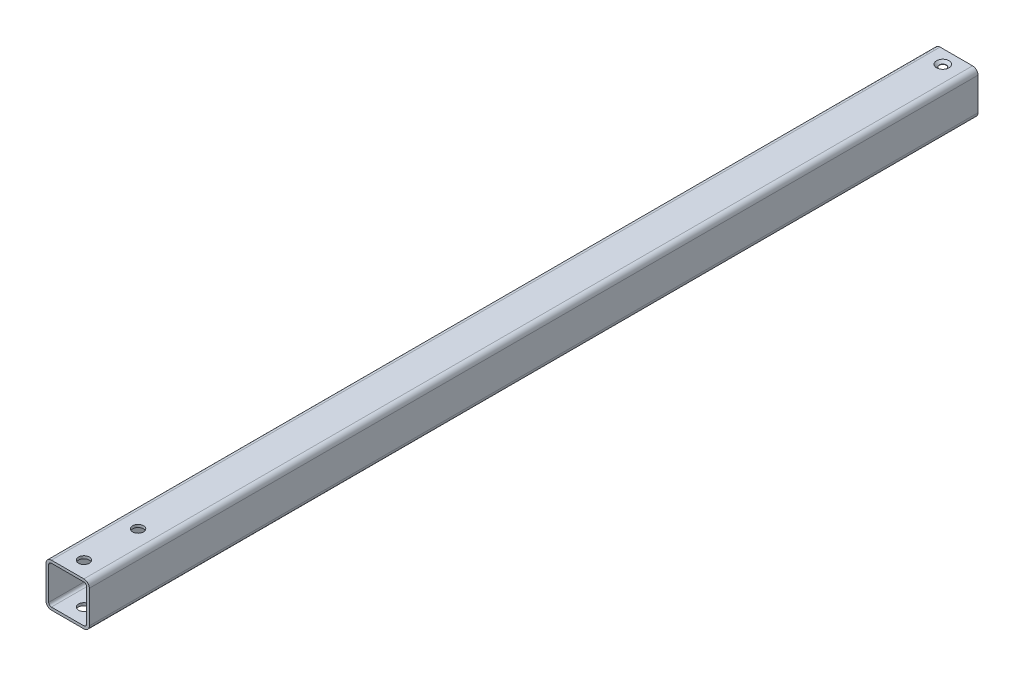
ISO-10303-21;
HEADER;
FILE_DESCRIPTION(('STEP AP214'),'2;1');
FILE_NAME('part.step','',(''),(''),'','','');
FILE_SCHEMA(('AUTOMOTIVE_DESIGN { 1 0 10303 214 1 1 1 1 }'));
ENDSEC;
DATA;
#1=APPLICATION_CONTEXT('core data for automotive mechanical design processes');
#2=APPLICATION_PROTOCOL_DEFINITION('international standard','automotive_design',2000,#1);
#3=PRODUCT_CONTEXT('',#1,'mechanical');
#4=PRODUCT('Part','Part','',(#3));
#5=PRODUCT_RELATED_PRODUCT_CATEGORY('part','',(#4));
#6=PRODUCT_DEFINITION_FORMATION('','',#4);
#7=PRODUCT_DEFINITION_CONTEXT('part definition',#1,'design');
#8=PRODUCT_DEFINITION('design','',#6,#7);
#9=PRODUCT_DEFINITION_SHAPE('','',#8);
#10=(LENGTH_UNIT() NAMED_UNIT(*) SI_UNIT(.MILLI.,.METRE.));
#11=(NAMED_UNIT(*) PLANE_ANGLE_UNIT() SI_UNIT($,.RADIAN.));
#12=(NAMED_UNIT(*) SI_UNIT($,.STERADIAN.) SOLID_ANGLE_UNIT());
#13=UNCERTAINTY_MEASURE_WITH_UNIT(LENGTH_MEASURE(1.E-05),#10,'distance_accuracy_value','');
#14=(GEOMETRIC_REPRESENTATION_CONTEXT(3) GLOBAL_UNCERTAINTY_ASSIGNED_CONTEXT((#13)) GLOBAL_UNIT_ASSIGNED_CONTEXT((#10,
#11,#12)) REPRESENTATION_CONTEXT('',''));
#15=CARTESIAN_POINT('',(0.,0.,0.));
#16=DIRECTION('',(0.,0.,1.));
#17=DIRECTION('',(1.,0.,0.));
#18=AXIS2_PLACEMENT_3D('',#15,#16,#17);
#19=CARTESIAN_POINT('',(12.7,12.7,520.7));
#20=DIRECTION('',(0.,-1.,0.));
#21=DIRECTION('',(1.,0.,0.));
#22=AXIS2_PLACEMENT_3D('',#19,#20,#21);
#23=PLANE('',#22);
#24=CARTESIAN_POINT('',(0.,12.7,479.425));
#25=DIRECTION('',(0.,-1.,0.));
#26=DIRECTION('',(1.,0.,0.));
#27=AXIS2_PLACEMENT_3D('',#24,#25,#26);
#28=CIRCLE('',#27,3.175);
#29=CARTESIAN_POINT('',(3.175,12.7,479.425));
#30=VERTEX_POINT('',#29);
#31=EDGE_CURVE('E285',#30,#30,#28,.T.);
#32=ORIENTED_EDGE('',*,*,#31,.T.);
#33=EDGE_LOOP('',(#32));
#34=FACE_BOUND('',#33,.T.);
#35=CARTESIAN_POINT('',(0.,12.7,511.175));
#36=DIRECTION('',(0.,-1.,0.));
#37=DIRECTION('',(1.,0.,0.));
#38=AXIS2_PLACEMENT_3D('',#35,#36,#37);
#39=CIRCLE('',#38,3.175);
#40=CARTESIAN_POINT('',(3.175,12.7,511.175));
#41=VERTEX_POINT('',#40);
#42=EDGE_CURVE('E280',#41,#41,#39,.T.);
#43=ORIENTED_EDGE('',*,*,#42,.T.);
#44=EDGE_LOOP('',(#43));
#45=FACE_BOUND('',#44,.T.);
#46=CARTESIAN_POINT('',(0.,12.7,7.9248));
#47=DIRECTION('',(0.,-1.,0.));
#48=DIRECTION('',(1.,0.,0.));
#49=AXIS2_PLACEMENT_3D('',#46,#47,#48);
#50=CIRCLE('',#49,3.63220000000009);
#51=CARTESIAN_POINT('',(3.63220000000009,12.7,7.9248));
#52=VERTEX_POINT('',#51);
#53=EDGE_CURVE('E12',#52,#52,#50,.T.);
#54=ORIENTED_EDGE('',*,*,#53,.T.);
#55=EDGE_LOOP('',(#54));
#56=FACE_BOUND('',#55,.T.);
#57=DIRECTION('',(-1.,0.,0.));
#58=VECTOR('',#57,1.);
#59=CARTESIAN_POINT('',(12.7,12.7,0.));
#60=LINE('',#59,#58);
#61=CARTESIAN_POINT('',(9.525,12.7,0.));
#62=VERTEX_POINT('',#61);
#63=CARTESIAN_POINT('',(-9.525,12.7,0.));
#64=VERTEX_POINT('',#63);
#65=EDGE_CURVE('E214',#62,#64,#60,.T.);
#66=ORIENTED_EDGE('',*,*,#65,.T.);
#67=DIRECTION('',(0.,0.,-1.));
#68=VECTOR('',#67,1.);
#69=CARTESIAN_POINT('',(-9.525,12.7,520.7));
#70=LINE('',#69,#68);
#71=CARTESIAN_POINT('',(-9.525,12.7,520.7));
#72=VERTEX_POINT('',#71);
#73=EDGE_CURVE('E178',#64,#72,#70,.F.);
#74=ORIENTED_EDGE('',*,*,#73,.T.);
#75=DIRECTION('',(-1.,0.,0.));
#76=VECTOR('',#75,1.);
#77=CARTESIAN_POINT('',(12.7,12.7,520.7));
#78=LINE('',#77,#76);
#79=CARTESIAN_POINT('',(9.525,12.7,520.7));
#80=VERTEX_POINT('',#79);
#81=EDGE_CURVE('E209',#80,#72,#78,.T.);
#82=ORIENTED_EDGE('',*,*,#81,.F.);
#83=DIRECTION('',(0.,0.,-1.));
#84=VECTOR('',#83,1.);
#85=CARTESIAN_POINT('',(9.525,12.7,520.7));
#86=LINE('',#85,#84);
#87=EDGE_CURVE('E183',#80,#62,#86,.T.);
#88=ORIENTED_EDGE('',*,*,#87,.T.);
#89=EDGE_LOOP('',(#66,#74,#82,#88));
#90=FACE_BOUND('',#89,.T.);
#91=ADVANCED_FACE('F56',(#34,#45,#56,#90),#23,.F.);
#92=CARTESIAN_POINT('',(0.,11.1252,520.7));
#93=DIRECTION('',(0.,-1.,0.));
#94=DIRECTION('',(1.,0.,0.));
#95=AXIS2_PLACEMENT_3D('',#92,#93,#94);
#96=PLANE('',#95);
#97=CARTESIAN_POINT('',(0.,11.1252,479.425));
#98=DIRECTION('',(0.,-1.,0.));
#99=DIRECTION('',(1.,0.,0.));
#100=AXIS2_PLACEMENT_3D('',#97,#98,#99);
#101=CIRCLE('',#100,3.175);
#102=CARTESIAN_POINT('',(3.175,11.1252,479.425));
#103=VERTEX_POINT('',#102);
#104=EDGE_CURVE('E292',#103,#103,#101,.T.);
#105=ORIENTED_EDGE('',*,*,#104,.F.);
#106=EDGE_LOOP('',(#105));
#107=FACE_BOUND('',#106,.T.);
#108=CARTESIAN_POINT('',(0.,11.1252,511.175));
#109=DIRECTION('',(0.,-1.,0.));
#110=DIRECTION('',(1.,0.,0.));
#111=AXIS2_PLACEMENT_3D('',#108,#109,#110);
#112=CIRCLE('',#111,3.175);
#113=CARTESIAN_POINT('',(3.175,11.1252,511.175));
#114=VERTEX_POINT('',#113);
#115=EDGE_CURVE('E289',#114,#114,#112,.T.);
#116=ORIENTED_EDGE('',*,*,#115,.F.);
#117=EDGE_LOOP('',(#116));
#118=FACE_BOUND('',#117,.T.);
#119=DIRECTION('',(-1.,0.,0.));
#120=VECTOR('',#119,1.);
#121=CARTESIAN_POINT('',(0.,11.1252,0.));
#122=LINE('',#121,#120);
#123=CARTESIAN_POINT('',(9.5504,11.1252,0.));
#124=VERTEX_POINT('',#123);
#125=CARTESIAN_POINT('',(-9.5504,11.1252,0.));
#126=VERTEX_POINT('',#125);
#127=EDGE_CURVE('E309',#124,#126,#122,.T.);
#128=ORIENTED_EDGE('',*,*,#127,.F.);
#129=DIRECTION('',(0.,0.,-1.));
#130=VECTOR('',#129,1.);
#131=CARTESIAN_POINT('',(9.5504,11.1252,520.7));
#132=LINE('',#131,#130);
#133=CARTESIAN_POINT('',(9.5504,11.1252,520.7));
#134=VERTEX_POINT('',#133);
#135=EDGE_CURVE('E80',#124,#134,#132,.F.);
#136=ORIENTED_EDGE('',*,*,#135,.T.);
#137=DIRECTION('',(-1.,0.,0.));
#138=VECTOR('',#137,1.);
#139=CARTESIAN_POINT('',(0.,11.1252,520.7));
#140=LINE('',#139,#138);
#141=CARTESIAN_POINT('',(-9.5504,11.1252,520.7));
#142=VERTEX_POINT('',#141);
#143=EDGE_CURVE('E201',#134,#142,#140,.T.);
#144=ORIENTED_EDGE('',*,*,#143,.T.);
#145=DIRECTION('',(0.,0.,-1.));
#146=VECTOR('',#145,1.);
#147=CARTESIAN_POINT('',(-9.5504,11.1252,0.));
#148=LINE('',#147,#146);
#149=EDGE_CURVE('E257',#142,#126,#148,.T.);
#150=ORIENTED_EDGE('',*,*,#149,.T.);
#151=EDGE_LOOP('',(#128,#136,#144,#150));
#152=FACE_BOUND('',#151,.T.);
#153=CARTESIAN_POINT('',(0.,11.1252,7.9248));
#154=DIRECTION('',(0.,-1.,0.));
#155=DIRECTION('',(1.,0.,0.));
#156=AXIS2_PLACEMENT_3D('',#153,#154,#155);
#157=CIRCLE('',#156,2.0574);
#158=CARTESIAN_POINT('',(2.0574,11.1252,7.9248));
#159=VERTEX_POINT('',#158);
#160=EDGE_CURVE('E276',#159,#159,#157,.F.);
#161=ORIENTED_EDGE('',*,*,#160,.T.);
#162=EDGE_LOOP('',(#161));
#163=FACE_BOUND('',#162,.T.);
#164=ADVANCED_FACE('F365',(#107,#118,#152,#163),#96,.T.);
#165=CARTESIAN_POINT('',(0.,0.,520.7));
#166=DIRECTION('',(0.,0.,1.));
#167=DIRECTION('',(1.,0.,0.));
#168=AXIS2_PLACEMENT_3D('',#165,#166,#167);
#169=PLANE('',#168);
#170=ORIENTED_EDGE('',*,*,#81,.T.);
#171=CARTESIAN_POINT('',(-9.525,9.525,520.7));
#172=DIRECTION('',(0.,0.,1.));
#173=DIRECTION('',(1.,0.,0.));
#174=AXIS2_PLACEMENT_3D('',#171,#172,#173);
#175=CIRCLE('',#174,3.175);
#176=CARTESIAN_POINT('',(-12.7,9.525,520.7));
#177=VERTEX_POINT('',#176);
#178=EDGE_CURVE('E230',#72,#177,#175,.T.);
#179=ORIENTED_EDGE('',*,*,#178,.T.);
#180=DIRECTION('',(0.,-1.,0.));
#181=VECTOR('',#180,1.);
#182=CARTESIAN_POINT('',(-12.7,12.7,520.7));
#183=LINE('',#182,#181);
#184=CARTESIAN_POINT('',(-12.7,-9.525,520.7));
#185=VERTEX_POINT('',#184);
#186=EDGE_CURVE('E193',#177,#185,#183,.T.);
#187=ORIENTED_EDGE('',*,*,#186,.T.);
#188=CARTESIAN_POINT('',(-9.525,-9.525,520.7));
#189=DIRECTION('',(0.,0.,1.));
#190=DIRECTION('',(1.,0.,0.));
#191=AXIS2_PLACEMENT_3D('',#188,#189,#190);
#192=CIRCLE('',#191,3.175);
#193=CARTESIAN_POINT('',(-9.525,-12.7,520.7));
#194=VERTEX_POINT('',#193);
#195=EDGE_CURVE('E228',#185,#194,#192,.T.);
#196=ORIENTED_EDGE('',*,*,#195,.T.);
#197=DIRECTION('',(1.,0.,0.));
#198=VECTOR('',#197,1.);
#199=CARTESIAN_POINT('',(12.7,-12.7,520.7));
#200=LINE('',#199,#198);
#201=CARTESIAN_POINT('',(9.525,-12.7,520.7));
#202=VERTEX_POINT('',#201);
#203=EDGE_CURVE('E325',#194,#202,#200,.T.);
#204=ORIENTED_EDGE('',*,*,#203,.T.);
#205=CARTESIAN_POINT('',(9.525,-9.525,520.7));
#206=DIRECTION('',(0.,0.,1.));
#207=DIRECTION('',(1.,0.,0.));
#208=AXIS2_PLACEMENT_3D('',#205,#206,#207);
#209=CIRCLE('',#208,3.175);
#210=CARTESIAN_POINT('',(12.7,-9.525,520.7));
#211=VERTEX_POINT('',#210);
#212=EDGE_CURVE('E226',#202,#211,#209,.T.);
#213=ORIENTED_EDGE('',*,*,#212,.T.);
#214=DIRECTION('',(0.,1.,0.));
#215=VECTOR('',#214,1.);
#216=CARTESIAN_POINT('',(12.7,12.7,520.7));
#217=LINE('',#216,#215);
#218=CARTESIAN_POINT('',(12.7,9.525,520.7));
#219=VERTEX_POINT('',#218);
#220=EDGE_CURVE('E327',#211,#219,#217,.T.);
#221=ORIENTED_EDGE('',*,*,#220,.T.);
#222=CARTESIAN_POINT('',(9.525,9.525,520.7));
#223=DIRECTION('',(0.,0.,1.));
#224=DIRECTION('',(1.,0.,0.));
#225=AXIS2_PLACEMENT_3D('',#222,#223,#224);
#226=CIRCLE('',#225,3.175);
#227=EDGE_CURVE('E224',#219,#80,#226,.T.);
#228=ORIENTED_EDGE('',*,*,#227,.T.);
#229=EDGE_LOOP('',(#170,#179,#187,#196,#204,#213,#221,#228));
#230=FACE_BOUND('',#229,.T.);
#231=DIRECTION('',(1.,0.,0.));
#232=VECTOR('',#231,1.);
#233=CARTESIAN_POINT('',(0.,-11.1252,520.7));
#234=LINE('',#233,#232);
#235=CARTESIAN_POINT('',(-9.5504,-11.1252,520.7));
#236=VERTEX_POINT('',#235);
#237=CARTESIAN_POINT('',(9.5504,-11.1252,520.7));
#238=VERTEX_POINT('',#237);
#239=EDGE_CURVE('E308',#236,#238,#234,.T.);
#240=ORIENTED_EDGE('',*,*,#239,.F.);
#241=CARTESIAN_POINT('',(-9.5504,-9.5504,520.7));
#242=DIRECTION('',(0.,0.,1.));
#243=DIRECTION('',(1.,0.,0.));
#244=AXIS2_PLACEMENT_3D('',#241,#242,#243);
#245=CIRCLE('',#244,1.5748);
#246=CARTESIAN_POINT('',(-11.1252,-9.5504,520.7));
#247=VERTEX_POINT('',#246);
#248=EDGE_CURVE('E263',#236,#247,#245,.F.);
#249=ORIENTED_EDGE('',*,*,#248,.T.);
#250=DIRECTION('',(0.,-1.,0.));
#251=VECTOR('',#250,1.);
#252=CARTESIAN_POINT('',(-11.1252,0.,520.7));
#253=LINE('',#252,#251);
#254=CARTESIAN_POINT('',(-11.1252,9.5504,520.7));
#255=VERTEX_POINT('',#254);
#256=EDGE_CURVE('E305',#255,#247,#253,.T.);
#257=ORIENTED_EDGE('',*,*,#256,.F.);
#258=CARTESIAN_POINT('',(-9.5504,9.5504,520.7));
#259=DIRECTION('',(0.,0.,1.));
#260=DIRECTION('',(1.,0.,0.));
#261=AXIS2_PLACEMENT_3D('',#258,#259,#260);
#262=CIRCLE('',#261,1.5748);
#263=EDGE_CURVE('E73',#255,#142,#262,.F.);
#264=ORIENTED_EDGE('',*,*,#263,.T.);
#265=ORIENTED_EDGE('',*,*,#143,.F.);
#266=CARTESIAN_POINT('',(9.5504,9.5504,520.7));
#267=DIRECTION('',(0.,0.,1.));
#268=DIRECTION('',(1.,0.,0.));
#269=AXIS2_PLACEMENT_3D('',#266,#267,#268);
#270=CIRCLE('',#269,1.5748);
#271=CARTESIAN_POINT('',(11.1252,9.5504,520.7));
#272=VERTEX_POINT('',#271);
#273=EDGE_CURVE('E271',#134,#272,#270,.F.);
#274=ORIENTED_EDGE('',*,*,#273,.T.);
#275=DIRECTION('',(0.,1.,0.));
#276=VECTOR('',#275,1.);
#277=CARTESIAN_POINT('',(11.1252,0.,520.7));
#278=LINE('',#277,#276);
#279=CARTESIAN_POINT('',(11.1252,-9.5504,520.7));
#280=VERTEX_POINT('',#279);
#281=EDGE_CURVE('E206',#280,#272,#278,.T.);
#282=ORIENTED_EDGE('',*,*,#281,.F.);
#283=CARTESIAN_POINT('',(9.5504,-9.5504,520.7));
#284=DIRECTION('',(0.,0.,1.));
#285=DIRECTION('',(1.,0.,0.));
#286=AXIS2_PLACEMENT_3D('',#283,#284,#285);
#287=CIRCLE('',#286,1.5748);
#288=EDGE_CURVE('E267',#280,#238,#287,.F.);
#289=ORIENTED_EDGE('',*,*,#288,.T.);
#290=EDGE_LOOP('',(#240,#249,#257,#264,#265,#274,#282,#289));
#291=FACE_BOUND('',#290,.T.);
#292=ADVANCED_FACE('F334',(#230,#291),#169,.T.);
#293=CARTESIAN_POINT('',(0.,0.,0.));
#294=DIRECTION('',(0.,0.,1.));
#295=DIRECTION('',(1.,0.,0.));
#296=AXIS2_PLACEMENT_3D('',#293,#294,#295);
#297=PLANE('',#296);
#298=DIRECTION('',(0.,-1.,0.));
#299=VECTOR('',#298,1.);
#300=CARTESIAN_POINT('',(-12.7,12.7,0.));
#301=LINE('',#300,#299);
#302=CARTESIAN_POINT('',(-12.7,9.525,0.));
#303=VERTEX_POINT('',#302);
#304=CARTESIAN_POINT('',(-12.7,-9.525,0.));
#305=VERTEX_POINT('',#304);
#306=EDGE_CURVE('E190',#303,#305,#301,.T.);
#307=ORIENTED_EDGE('',*,*,#306,.F.);
#308=CARTESIAN_POINT('',(-9.525,9.525,0.));
#309=DIRECTION('',(0.,0.,1.));
#310=DIRECTION('',(1.,0.,0.));
#311=AXIS2_PLACEMENT_3D('',#308,#309,#310);
#312=CIRCLE('',#311,3.175);
#313=EDGE_CURVE('E173',#303,#64,#312,.F.);
#314=ORIENTED_EDGE('',*,*,#313,.T.);
#315=ORIENTED_EDGE('',*,*,#65,.F.);
#316=CARTESIAN_POINT('',(9.525,9.525,0.));
#317=DIRECTION('',(0.,0.,1.));
#318=DIRECTION('',(1.,0.,0.));
#319=AXIS2_PLACEMENT_3D('',#316,#317,#318);
#320=CIRCLE('',#319,3.175);
#321=CARTESIAN_POINT('',(12.7,9.525,0.));
#322=VERTEX_POINT('',#321);
#323=EDGE_CURVE('E194',#62,#322,#320,.F.);
#324=ORIENTED_EDGE('',*,*,#323,.T.);
#325=DIRECTION('',(0.,1.,0.));
#326=VECTOR('',#325,1.);
#327=CARTESIAN_POINT('',(12.7,12.7,0.));
#328=LINE('',#327,#326);
#329=CARTESIAN_POINT('',(12.7,-9.525,0.));
#330=VERTEX_POINT('',#329);
#331=EDGE_CURVE('E204',#330,#322,#328,.T.);
#332=ORIENTED_EDGE('',*,*,#331,.F.);
#333=CARTESIAN_POINT('',(9.525,-9.525,0.));
#334=DIRECTION('',(0.,0.,1.));
#335=DIRECTION('',(1.,0.,0.));
#336=AXIS2_PLACEMENT_3D('',#333,#334,#335);
#337=CIRCLE('',#336,3.175);
#338=CARTESIAN_POINT('',(9.525,-12.7,0.));
#339=VERTEX_POINT('',#338);
#340=EDGE_CURVE('E218',#330,#339,#337,.F.);
#341=ORIENTED_EDGE('',*,*,#340,.T.);
#342=DIRECTION('',(1.,0.,0.));
#343=VECTOR('',#342,1.);
#344=CARTESIAN_POINT('',(12.7,-12.7,0.));
#345=LINE('',#344,#343);
#346=CARTESIAN_POINT('',(-9.525,-12.7,0.));
#347=VERTEX_POINT('',#346);
#348=EDGE_CURVE('E200',#347,#339,#345,.T.);
#349=ORIENTED_EDGE('',*,*,#348,.F.);
#350=CARTESIAN_POINT('',(-9.525,-9.525,0.));
#351=DIRECTION('',(0.,0.,1.));
#352=DIRECTION('',(1.,0.,0.));
#353=AXIS2_PLACEMENT_3D('',#350,#351,#352);
#354=CIRCLE('',#353,3.175);
#355=EDGE_CURVE('E184',#347,#305,#354,.F.);
#356=ORIENTED_EDGE('',*,*,#355,.T.);
#357=EDGE_LOOP('',(#307,#314,#315,#324,#332,#341,#349,#356));
#358=FACE_BOUND('',#357,.T.);
#359=ORIENTED_EDGE('',*,*,#127,.T.);
#360=CARTESIAN_POINT('',(-9.5504,9.5504,0.));
#361=DIRECTION('',(0.,0.,1.));
#362=DIRECTION('',(1.,0.,0.));
#363=AXIS2_PLACEMENT_3D('',#360,#361,#362);
#364=CIRCLE('',#363,1.5748);
#365=CARTESIAN_POINT('',(-11.1252,9.5504,0.));
#366=VERTEX_POINT('',#365);
#367=EDGE_CURVE('E273',#126,#366,#364,.T.);
#368=ORIENTED_EDGE('',*,*,#367,.T.);
#369=DIRECTION('',(0.,-1.,0.));
#370=VECTOR('',#369,1.);
#371=CARTESIAN_POINT('',(-11.1252,0.,0.));
#372=LINE('',#371,#370);
#373=CARTESIAN_POINT('',(-11.1252,-9.5504,0.));
#374=VERTEX_POINT('',#373);
#375=EDGE_CURVE('E279',#366,#374,#372,.T.);
#376=ORIENTED_EDGE('',*,*,#375,.T.);
#377=CARTESIAN_POINT('',(-9.5504,-9.5504,0.));
#378=DIRECTION('',(0.,0.,1.));
#379=DIRECTION('',(1.,0.,0.));
#380=AXIS2_PLACEMENT_3D('',#377,#378,#379);
#381=CIRCLE('',#380,1.5748);
#382=CARTESIAN_POINT('',(-9.5504,-11.1252,0.));
#383=VERTEX_POINT('',#382);
#384=EDGE_CURVE('E261',#374,#383,#381,.T.);
#385=ORIENTED_EDGE('',*,*,#384,.T.);
#386=DIRECTION('',(1.,0.,0.));
#387=VECTOR('',#386,1.);
#388=CARTESIAN_POINT('',(0.,-11.1252,0.));
#389=LINE('',#388,#387);
#390=CARTESIAN_POINT('',(9.5504,-11.1252,0.));
#391=VERTEX_POINT('',#390);
#392=EDGE_CURVE('E316',#383,#391,#389,.T.);
#393=ORIENTED_EDGE('',*,*,#392,.T.);
#394=CARTESIAN_POINT('',(9.5504,-9.5504,0.));
#395=DIRECTION('',(0.,0.,1.));
#396=DIRECTION('',(1.,0.,0.));
#397=AXIS2_PLACEMENT_3D('',#394,#395,#396);
#398=CIRCLE('',#397,1.5748);
#399=CARTESIAN_POINT('',(11.1252,-9.5504,0.));
#400=VERTEX_POINT('',#399);
#401=EDGE_CURVE('E265',#391,#400,#398,.T.);
#402=ORIENTED_EDGE('',*,*,#401,.T.);
#403=DIRECTION('',(0.,1.,0.));
#404=VECTOR('',#403,1.);
#405=CARTESIAN_POINT('',(11.1252,0.,0.));
#406=LINE('',#405,#404);
#407=CARTESIAN_POINT('',(11.1252,9.5504,0.));
#408=VERTEX_POINT('',#407);
#409=EDGE_CURVE('E319',#400,#408,#406,.T.);
#410=ORIENTED_EDGE('',*,*,#409,.T.);
#411=CARTESIAN_POINT('',(9.5504,9.5504,0.));
#412=DIRECTION('',(0.,0.,1.));
#413=DIRECTION('',(1.,0.,0.));
#414=AXIS2_PLACEMENT_3D('',#411,#412,#413);
#415=CIRCLE('',#414,1.5748);
#416=EDGE_CURVE('E269',#408,#124,#415,.T.);
#417=ORIENTED_EDGE('',*,*,#416,.T.);
#418=EDGE_LOOP('',(#359,#368,#376,#385,#393,#402,#410,#417));
#419=FACE_BOUND('',#418,.T.);
#420=ADVANCED_FACE('F197',(#358,#419),#297,.F.);
#421=CARTESIAN_POINT('',(-12.7,12.7,520.7));
#422=DIRECTION('',(1.,0.,0.));
#423=DIRECTION('',(0.,1.,0.));
#424=AXIS2_PLACEMENT_3D('',#421,#422,#423);
#425=PLANE('',#424);
#426=ORIENTED_EDGE('',*,*,#186,.F.);
#427=DIRECTION('',(0.,0.,-1.));
#428=VECTOR('',#427,1.);
#429=CARTESIAN_POINT('',(-12.7,9.525,520.7));
#430=LINE('',#429,#428);
#431=EDGE_CURVE('E177',#177,#303,#430,.T.);
#432=ORIENTED_EDGE('',*,*,#431,.T.);
#433=ORIENTED_EDGE('',*,*,#306,.T.);
#434=DIRECTION('',(0.,0.,-1.));
#435=VECTOR('',#434,1.);
#436=CARTESIAN_POINT('',(-12.7,-9.525,520.7));
#437=LINE('',#436,#435);
#438=EDGE_CURVE('E195',#305,#185,#437,.F.);
#439=ORIENTED_EDGE('',*,*,#438,.T.);
#440=EDGE_LOOP('',(#426,#432,#433,#439));
#441=FACE_BOUND('',#440,.T.);
#442=ADVANCED_FACE('F189',(#441),#425,.F.);
#443=CARTESIAN_POINT('',(12.7,-12.7,520.7));
#444=DIRECTION('',(0.,1.,0.));
#445=DIRECTION('',(0.,0.,1.));
#446=AXIS2_PLACEMENT_3D('',#443,#444,#445);
#447=PLANE('',#446);
#448=CARTESIAN_POINT('',(0.,-12.7,479.425));
#449=DIRECTION('',(0.,1.,0.));
#450=DIRECTION('',(0.,0.,1.));
#451=AXIS2_PLACEMENT_3D('',#448,#449,#450);
#452=CIRCLE('',#451,3.175);
#453=CARTESIAN_POINT('',(0.,-12.7,482.6));
#454=VERTEX_POINT('',#453);
#455=EDGE_CURVE('E297',#454,#454,#452,.T.);
#456=ORIENTED_EDGE('',*,*,#455,.T.);
#457=EDGE_LOOP('',(#456));
#458=FACE_BOUND('',#457,.T.);
#459=CARTESIAN_POINT('',(0.,-12.7,511.175));
#460=DIRECTION('',(0.,1.,0.));
#461=DIRECTION('',(0.,0.,1.));
#462=AXIS2_PLACEMENT_3D('',#459,#460,#461);
#463=CIRCLE('',#462,3.175);
#464=CARTESIAN_POINT('',(0.,-12.7,514.35));
#465=VERTEX_POINT('',#464);
#466=EDGE_CURVE('E284',#465,#465,#463,.T.);
#467=ORIENTED_EDGE('',*,*,#466,.T.);
#468=EDGE_LOOP('',(#467));
#469=FACE_BOUND('',#468,.T.);
#470=ORIENTED_EDGE('',*,*,#203,.F.);
#471=DIRECTION('',(0.,0.,-1.));
#472=VECTOR('',#471,1.);
#473=CARTESIAN_POINT('',(-9.525,-12.7,520.7));
#474=LINE('',#473,#472);
#475=EDGE_CURVE('E234',#194,#347,#474,.T.);
#476=ORIENTED_EDGE('',*,*,#475,.T.);
#477=ORIENTED_EDGE('',*,*,#348,.T.);
#478=DIRECTION('',(0.,0.,-1.));
#479=VECTOR('',#478,1.);
#480=CARTESIAN_POINT('',(9.525,-12.7,520.7));
#481=LINE('',#480,#479);
#482=EDGE_CURVE('E232',#339,#202,#481,.F.);
#483=ORIENTED_EDGE('',*,*,#482,.T.);
#484=EDGE_LOOP('',(#470,#476,#477,#483));
#485=FACE_BOUND('',#484,.T.);
#486=ADVANCED_FACE('F350',(#458,#469,#485),#447,.F.);
#487=CARTESIAN_POINT('',(12.7,12.7,520.7));
#488=DIRECTION('',(-1.,0.,0.));
#489=DIRECTION('',(0.,-1.,0.));
#490=AXIS2_PLACEMENT_3D('',#487,#488,#489);
#491=PLANE('',#490);
#492=ORIENTED_EDGE('',*,*,#220,.F.);
#493=DIRECTION('',(0.,0.,-1.));
#494=VECTOR('',#493,1.);
#495=CARTESIAN_POINT('',(12.7,-9.525,520.7));
#496=LINE('',#495,#494);
#497=EDGE_CURVE('E239',#211,#330,#496,.T.);
#498=ORIENTED_EDGE('',*,*,#497,.T.);
#499=ORIENTED_EDGE('',*,*,#331,.T.);
#500=DIRECTION('',(0.,0.,-1.));
#501=VECTOR('',#500,1.);
#502=CARTESIAN_POINT('',(12.7,9.525,520.7));
#503=LINE('',#502,#501);
#504=EDGE_CURVE('E237',#322,#219,#503,.F.);
#505=ORIENTED_EDGE('',*,*,#504,.T.);
#506=EDGE_LOOP('',(#492,#498,#499,#505));
#507=FACE_BOUND('',#506,.T.);
#508=ADVANCED_FACE('F342',(#507),#491,.F.);
#509=CARTESIAN_POINT('',(-11.1252,0.,520.7));
#510=DIRECTION('',(1.,0.,0.));
#511=DIRECTION('',(0.,1.,0.));
#512=AXIS2_PLACEMENT_3D('',#509,#510,#511);
#513=PLANE('',#512);
#514=ORIENTED_EDGE('',*,*,#256,.T.);
#515=DIRECTION('',(0.,0.,-1.));
#516=VECTOR('',#515,1.);
#517=CARTESIAN_POINT('',(-11.1252,-9.5504,0.));
#518=LINE('',#517,#516);
#519=EDGE_CURVE('E244',#247,#374,#518,.T.);
#520=ORIENTED_EDGE('',*,*,#519,.T.);
#521=ORIENTED_EDGE('',*,*,#375,.F.);
#522=DIRECTION('',(0.,0.,-1.));
#523=VECTOR('',#522,1.);
#524=CARTESIAN_POINT('',(-11.1252,9.5504,520.7));
#525=LINE('',#524,#523);
#526=EDGE_CURVE('E242',#366,#255,#525,.F.);
#527=ORIENTED_EDGE('',*,*,#526,.T.);
#528=EDGE_LOOP('',(#514,#520,#521,#527));
#529=FACE_BOUND('',#528,.T.);
#530=ADVANCED_FACE('F378',(#529),#513,.T.);
#531=CARTESIAN_POINT('',(0.,-11.1252,520.7));
#532=DIRECTION('',(0.,1.,0.));
#533=DIRECTION('',(0.,0.,1.));
#534=AXIS2_PLACEMENT_3D('',#531,#532,#533);
#535=PLANE('',#534);
#536=CARTESIAN_POINT('',(0.,-11.1252,479.425));
#537=DIRECTION('',(0.,1.,0.));
#538=DIRECTION('',(0.,0.,1.));
#539=AXIS2_PLACEMENT_3D('',#536,#537,#538);
#540=CIRCLE('',#539,3.175);
#541=CARTESIAN_POINT('',(0.,-11.1252,482.6));
#542=VERTEX_POINT('',#541);
#543=EDGE_CURVE('E60',#542,#542,#540,.T.);
#544=ORIENTED_EDGE('',*,*,#543,.F.);
#545=EDGE_LOOP('',(#544));
#546=FACE_BOUND('',#545,.T.);
#547=CARTESIAN_POINT('',(0.,-11.1252,511.175));
#548=DIRECTION('',(0.,1.,0.));
#549=DIRECTION('',(0.,0.,1.));
#550=AXIS2_PLACEMENT_3D('',#547,#548,#549);
#551=CIRCLE('',#550,3.175);
#552=CARTESIAN_POINT('',(0.,-11.1252,514.35));
#553=VERTEX_POINT('',#552);
#554=EDGE_CURVE('E282',#553,#553,#551,.T.);
#555=ORIENTED_EDGE('',*,*,#554,.F.);
#556=EDGE_LOOP('',(#555));
#557=FACE_BOUND('',#556,.T.);
#558=ORIENTED_EDGE('',*,*,#392,.F.);
#559=DIRECTION('',(0.,0.,-1.));
#560=VECTOR('',#559,1.);
#561=CARTESIAN_POINT('',(-9.5504,-11.1252,520.7));
#562=LINE('',#561,#560);
#563=EDGE_CURVE('E250',#383,#236,#562,.F.);
#564=ORIENTED_EDGE('',*,*,#563,.T.);
#565=ORIENTED_EDGE('',*,*,#239,.T.);
#566=DIRECTION('',(0.,0.,-1.));
#567=VECTOR('',#566,1.);
#568=CARTESIAN_POINT('',(9.5504,-11.1252,0.));
#569=LINE('',#568,#567);
#570=EDGE_CURVE('E247',#238,#391,#569,.T.);
#571=ORIENTED_EDGE('',*,*,#570,.T.);
#572=EDGE_LOOP('',(#558,#564,#565,#571));
#573=FACE_BOUND('',#572,.T.);
#574=ADVANCED_FACE('F394',(#546,#557,#573),#535,.T.);
#575=CARTESIAN_POINT('',(11.1252,0.,520.7));
#576=DIRECTION('',(-1.,0.,0.));
#577=DIRECTION('',(0.,-1.,0.));
#578=AXIS2_PLACEMENT_3D('',#575,#576,#577);
#579=PLANE('',#578);
#580=ORIENTED_EDGE('',*,*,#409,.F.);
#581=DIRECTION('',(0.,0.,-1.));
#582=VECTOR('',#581,1.);
#583=CARTESIAN_POINT('',(11.1252,-9.5504,520.7));
#584=LINE('',#583,#582);
#585=EDGE_CURVE('E255',#400,#280,#584,.F.);
#586=ORIENTED_EDGE('',*,*,#585,.T.);
#587=ORIENTED_EDGE('',*,*,#281,.T.);
#588=DIRECTION('',(0.,0.,-1.));
#589=VECTOR('',#588,1.);
#590=CARTESIAN_POINT('',(11.1252,9.5504,0.));
#591=LINE('',#590,#589);
#592=EDGE_CURVE('E252',#272,#408,#591,.T.);
#593=ORIENTED_EDGE('',*,*,#592,.T.);
#594=EDGE_LOOP('',(#580,#586,#587,#593));
#595=FACE_BOUND('',#594,.T.);
#596=ADVANCED_FACE('F362',(#595),#579,.T.);
#597=CARTESIAN_POINT('',(-9.525,9.525,520.7));
#598=DIRECTION('',(0.,0.,-1.));
#599=DIRECTION('',(-1.,0.,0.));
#600=AXIS2_PLACEMENT_3D('',#597,#598,#599);
#601=CYLINDRICAL_SURFACE('',#600,3.175);
#602=ORIENTED_EDGE('',*,*,#178,.F.);
#603=ORIENTED_EDGE('',*,*,#73,.F.);
#604=ORIENTED_EDGE('',*,*,#313,.F.);
#605=ORIENTED_EDGE('',*,*,#431,.F.);
#606=EDGE_LOOP('',(#602,#603,#604,#605));
#607=FACE_BOUND('',#606,.T.);
#608=ADVANCED_FACE('F176',(#607),#601,.T.);
#609=CARTESIAN_POINT('',(-9.525,-9.525,520.7));
#610=DIRECTION('',(0.,0.,-1.));
#611=DIRECTION('',(-1.,0.,0.));
#612=AXIS2_PLACEMENT_3D('',#609,#610,#611);
#613=CYLINDRICAL_SURFACE('',#612,3.175);
#614=ORIENTED_EDGE('',*,*,#195,.F.);
#615=ORIENTED_EDGE('',*,*,#438,.F.);
#616=ORIENTED_EDGE('',*,*,#355,.F.);
#617=ORIENTED_EDGE('',*,*,#475,.F.);
#618=EDGE_LOOP('',(#614,#615,#616,#617));
#619=FACE_BOUND('',#618,.T.);
#620=ADVANCED_FACE('F354',(#619),#613,.T.);
#621=CARTESIAN_POINT('',(9.525,-9.525,520.7));
#622=DIRECTION('',(0.,0.,-1.));
#623=DIRECTION('',(-1.,0.,0.));
#624=AXIS2_PLACEMENT_3D('',#621,#622,#623);
#625=CYLINDRICAL_SURFACE('',#624,3.175);
#626=ORIENTED_EDGE('',*,*,#212,.F.);
#627=ORIENTED_EDGE('',*,*,#482,.F.);
#628=ORIENTED_EDGE('',*,*,#340,.F.);
#629=ORIENTED_EDGE('',*,*,#497,.F.);
#630=EDGE_LOOP('',(#626,#627,#628,#629));
#631=FACE_BOUND('',#630,.T.);
#632=ADVANCED_FACE('F346',(#631),#625,.T.);
#633=CARTESIAN_POINT('',(9.525,9.525,520.7));
#634=DIRECTION('',(0.,0.,-1.));
#635=DIRECTION('',(-1.,0.,0.));
#636=AXIS2_PLACEMENT_3D('',#633,#634,#635);
#637=CYLINDRICAL_SURFACE('',#636,3.175);
#638=ORIENTED_EDGE('',*,*,#227,.F.);
#639=ORIENTED_EDGE('',*,*,#504,.F.);
#640=ORIENTED_EDGE('',*,*,#323,.F.);
#641=ORIENTED_EDGE('',*,*,#87,.F.);
#642=EDGE_LOOP('',(#638,#639,#640,#641));
#643=FACE_BOUND('',#642,.T.);
#644=ADVANCED_FACE('F338',(#643),#637,.T.);
#645=CARTESIAN_POINT('',(-9.5504,-9.5504,520.7));
#646=DIRECTION('',(0.,0.,1.));
#647=DIRECTION('',(1.,0.,0.));
#648=AXIS2_PLACEMENT_3D('',#645,#646,#647);
#649=CYLINDRICAL_SURFACE('',#648,1.5748);
#650=ORIENTED_EDGE('',*,*,#248,.F.);
#651=ORIENTED_EDGE('',*,*,#563,.F.);
#652=ORIENTED_EDGE('',*,*,#384,.F.);
#653=ORIENTED_EDGE('',*,*,#519,.F.);
#654=EDGE_LOOP('',(#650,#651,#652,#653));
#655=FACE_BOUND('',#654,.T.);
#656=ADVANCED_FACE('F445',(#655),#649,.F.);
#657=CARTESIAN_POINT('',(9.5504,-9.5504,520.7));
#658=DIRECTION('',(0.,0.,1.));
#659=DIRECTION('',(1.,0.,0.));
#660=AXIS2_PLACEMENT_3D('',#657,#658,#659);
#661=CYLINDRICAL_SURFACE('',#660,1.5748);
#662=ORIENTED_EDGE('',*,*,#288,.F.);
#663=ORIENTED_EDGE('',*,*,#585,.F.);
#664=ORIENTED_EDGE('',*,*,#401,.F.);
#665=ORIENTED_EDGE('',*,*,#570,.F.);
#666=EDGE_LOOP('',(#662,#663,#664,#665));
#667=FACE_BOUND('',#666,.T.);
#668=ADVANCED_FACE('F438',(#667),#661,.F.);
#669=CARTESIAN_POINT('',(9.5504,9.5504,520.7));
#670=DIRECTION('',(0.,0.,1.));
#671=DIRECTION('',(1.,0.,0.));
#672=AXIS2_PLACEMENT_3D('',#669,#670,#671);
#673=CYLINDRICAL_SURFACE('',#672,1.5748);
#674=ORIENTED_EDGE('',*,*,#273,.F.);
#675=ORIENTED_EDGE('',*,*,#135,.F.);
#676=ORIENTED_EDGE('',*,*,#416,.F.);
#677=ORIENTED_EDGE('',*,*,#592,.F.);
#678=EDGE_LOOP('',(#674,#675,#676,#677));
#679=FACE_BOUND('',#678,.T.);
#680=ADVANCED_FACE('F430',(#679),#673,.F.);
#681=CARTESIAN_POINT('',(-9.5504,9.5504,520.7));
#682=DIRECTION('',(0.,0.,1.));
#683=DIRECTION('',(1.,0.,0.));
#684=AXIS2_PLACEMENT_3D('',#681,#682,#683);
#685=CYLINDRICAL_SURFACE('',#684,1.5748);
#686=ORIENTED_EDGE('',*,*,#263,.F.);
#687=ORIENTED_EDGE('',*,*,#526,.F.);
#688=ORIENTED_EDGE('',*,*,#367,.F.);
#689=ORIENTED_EDGE('',*,*,#149,.F.);
#690=EDGE_LOOP('',(#686,#687,#688,#689));
#691=FACE_BOUND('',#690,.T.);
#692=ADVANCED_FACE('F405',(#691),#685,.F.);
#693=CARTESIAN_POINT('',(0.,25.4,7.9248));
#694=DIRECTION('',(0.,-1.,0.));
#695=DIRECTION('',(0.,0.,-1.));
#696=AXIS2_PLACEMENT_3D('',#693,#694,#695);
#697=CYLINDRICAL_SURFACE('',#696,2.0574);
#698=CARTESIAN_POINT('',(0.,11.3310472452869,7.9248));
#699=DIRECTION('',(0.,-1.,0.));
#700=DIRECTION('',(0.,0.,-1.));
#701=AXIS2_PLACEMENT_3D('',#698,#699,#700);
#702=CIRCLE('',#701,2.0574);
#703=CARTESIAN_POINT('',(0.,11.3310472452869,5.8674));
#704=VERTEX_POINT('',#703);
#705=EDGE_CURVE('E65',#704,#704,#702,.F.);
#706=ORIENTED_EDGE('',*,*,#705,.T.);
#707=EDGE_LOOP('',(#706));
#708=FACE_BOUND('',#707,.T.);
#709=ORIENTED_EDGE('',*,*,#160,.F.);
#710=EDGE_LOOP('',(#709));
#711=FACE_BOUND('',#710,.T.);
#712=ADVANCED_FACE('F402',(#708,#711),#697,.F.);
#713=CARTESIAN_POINT('',(0.,11.3310472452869,7.9248));
#714=DIRECTION('',(0.,1.,0.));
#715=DIRECTION('',(0.,0.,1.));
#716=AXIS2_PLACEMENT_3D('',#713,#714,#715);
#717=CONICAL_SURFACE('',#716,2.0574,0.855211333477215);
#718=ORIENTED_EDGE('',*,*,#53,.F.);
#719=EDGE_LOOP('',(#718));
#720=FACE_BOUND('',#719,.T.);
#721=ORIENTED_EDGE('',*,*,#705,.F.);
#722=EDGE_LOOP('',(#721));
#723=FACE_BOUND('',#722,.T.);
#724=ADVANCED_FACE('F58',(#720,#723),#717,.F.);
#725=CARTESIAN_POINT('',(0.,-25.4,511.175));
#726=DIRECTION('',(0.,1.,0.));
#727=DIRECTION('',(0.,0.,1.));
#728=AXIS2_PLACEMENT_3D('',#725,#726,#727);
#729=CYLINDRICAL_SURFACE('',#728,3.175);
#730=ORIENTED_EDGE('',*,*,#554,.T.);
#731=EDGE_LOOP('',(#730));
#732=FACE_BOUND('',#731,.T.);
#733=ORIENTED_EDGE('',*,*,#466,.F.);
#734=EDGE_LOOP('',(#733));
#735=FACE_BOUND('',#734,.T.);
#736=ADVANCED_FACE('F411',(#732,#735),#729,.F.);
#737=ORIENTED_EDGE('',*,*,#115,.T.);
#738=EDGE_LOOP('',(#737));
#739=FACE_BOUND('',#738,.T.);
#740=ORIENTED_EDGE('',*,*,#42,.F.);
#741=EDGE_LOOP('',(#740));
#742=FACE_BOUND('',#741,.T.);
#743=ADVANCED_FACE('F407',(#739,#742),#729,.F.);
#744=CARTESIAN_POINT('',(0.,-25.4,479.425));
#745=DIRECTION('',(0.,1.,0.));
#746=DIRECTION('',(0.,0.,1.));
#747=AXIS2_PLACEMENT_3D('',#744,#745,#746);
#748=CYLINDRICAL_SURFACE('',#747,3.175);
#749=ORIENTED_EDGE('',*,*,#543,.T.);
#750=EDGE_LOOP('',(#749));
#751=FACE_BOUND('',#750,.T.);
#752=ORIENTED_EDGE('',*,*,#455,.F.);
#753=EDGE_LOOP('',(#752));
#754=FACE_BOUND('',#753,.T.);
#755=ADVANCED_FACE('F410',(#751,#754),#748,.F.);
#756=ORIENTED_EDGE('',*,*,#104,.T.);
#757=EDGE_LOOP('',(#756));
#758=FACE_BOUND('',#757,.T.);
#759=ORIENTED_EDGE('',*,*,#31,.F.);
#760=EDGE_LOOP('',(#759));
#761=FACE_BOUND('',#760,.T.);
#762=ADVANCED_FACE('F413',(#758,#761),#748,.F.);
#763=CLOSED_SHELL('',(#91,#164,#292,#420,#442,#486,#508,#530,#574,#596,#608,#620,#632,#644,#656,
#668,#680,#692,#712,#724,#736,#743,#755,#762));
#764=MANIFOLD_SOLID_BREP('B2',#763);
#765=ADVANCED_BREP_SHAPE_REPRESENTATION('',(#18,#764),#14);
#766=SHAPE_DEFINITION_REPRESENTATION(#9,#765);
ENDSEC;
END-ISO-10303-21;
